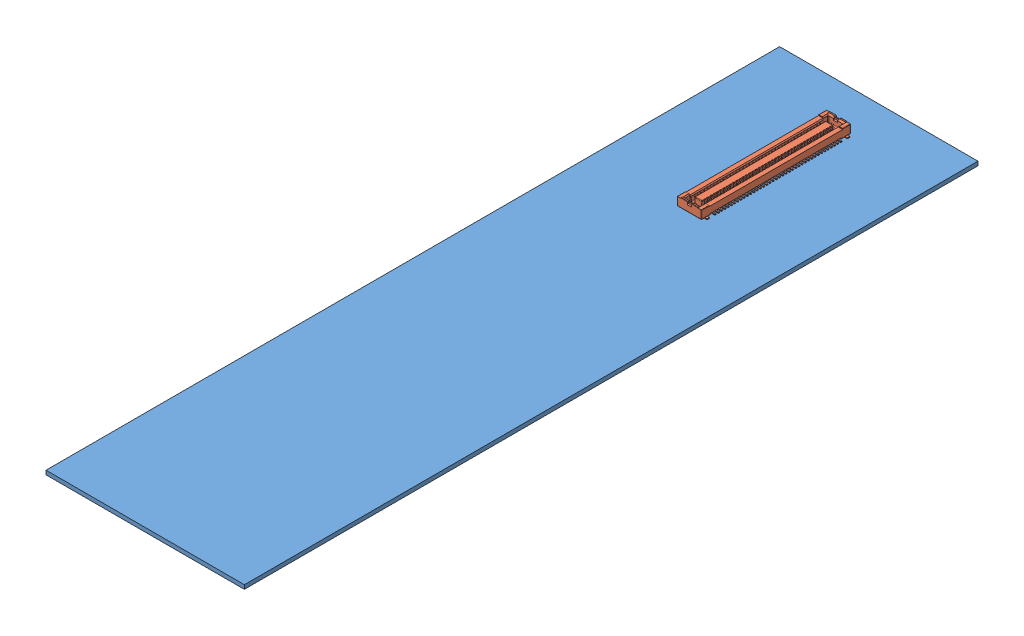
SolidWorks assembly PXL_Outer_Ladder_Driver_Board.SLDASM, configuration Default (file format 4700). Lengths in mm.
Overall size (24.61 1.67 91).
2 component instances, 2 part files, 4 mates.
Components (placement in the parent):
- PXL_Outer_Ladder_Driver_Board-1: PXL_Outer_Ladder_Driver_Board.SLDPRT [Default] at origin size (24.61 0.5 91)
- 80pin_Header_axt580224-1: 80pin_Header_axt580224.SLDPRT [Default] at (0 0.5 -185.8796) x (0 0 -1) z (0 1 0) size (18.5 3.6 1.17)
Mates (geometry in assembly coordinates):
- Coincident1: coordinate: point of PXL_Outer_Ladder_Driver_Board-1; point of assembly
- Coincident2: coincident anti-aligned: plane of PXL_Outer_Ladder_Driver_Board-1 through (-12.3027 0.5 -109.1296) normal (0 1 0); plane of 80pin_Header_axt580224-1 through (3.4527 0.5 -194.3496) normal (0 -1 0)
- Distance1: distance = 5 mm aligned: plane of 80pin_Header_axt580224-1 through (1.5 1.59 -195.1296) normal (0 0 -1); plane of PXL_Outer_Ladder_Driver_Board-1 through (-12.3027 0.5 -200.1296) normal (0 0 -1)
- Coincident4: coincident: moEndPointRef_w of 80pin_Header_axt580224-1; plane of assembly
